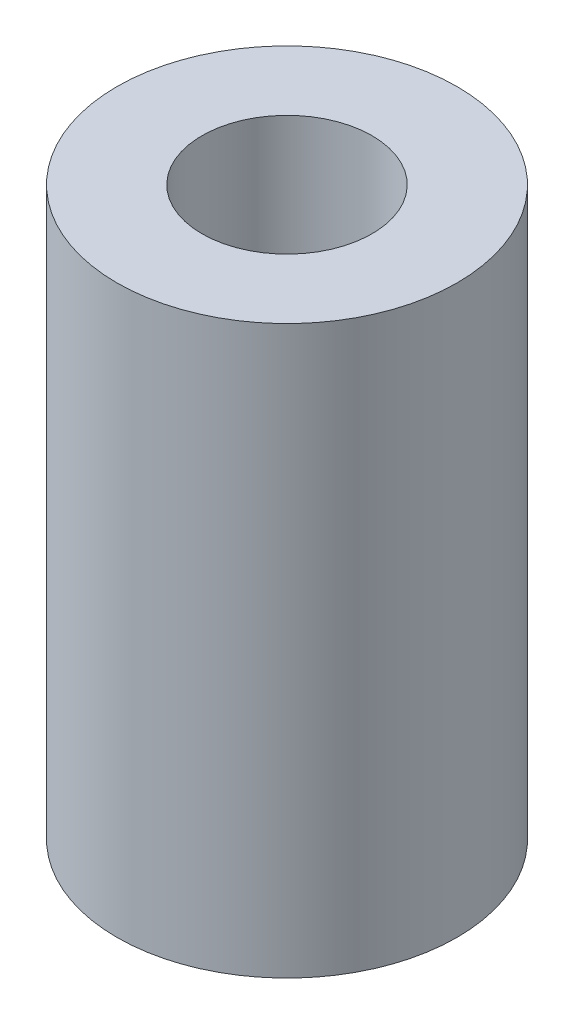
from build123d import *

# Parameters (mm, degrees)
ESQUISSE1_R      = 3
ESQUISSE1_R_2    = 1.5
EXTRUSION1_DEPTH = 10


with BuildPart() as part:
    # Esquisse1 → Extrusion1 (new body)
    with BuildSketch(Plane(origin=(0, 0, 0), x_dir=(1, 0, 0), z_dir=(0, 1, 0))):
        with Locations(Location((0, 0, 0), (0, 0, 270))):
            Circle(ESQUISSE1_R)
        with Locations(Location((0, 0, 0), (0, 0, 270))):
            Circle(ESQUISSE1_R_2, mode=Mode.SUBTRACT)
    extrude(amount=EXTRUSION1_DEPTH)


solid = part.part
